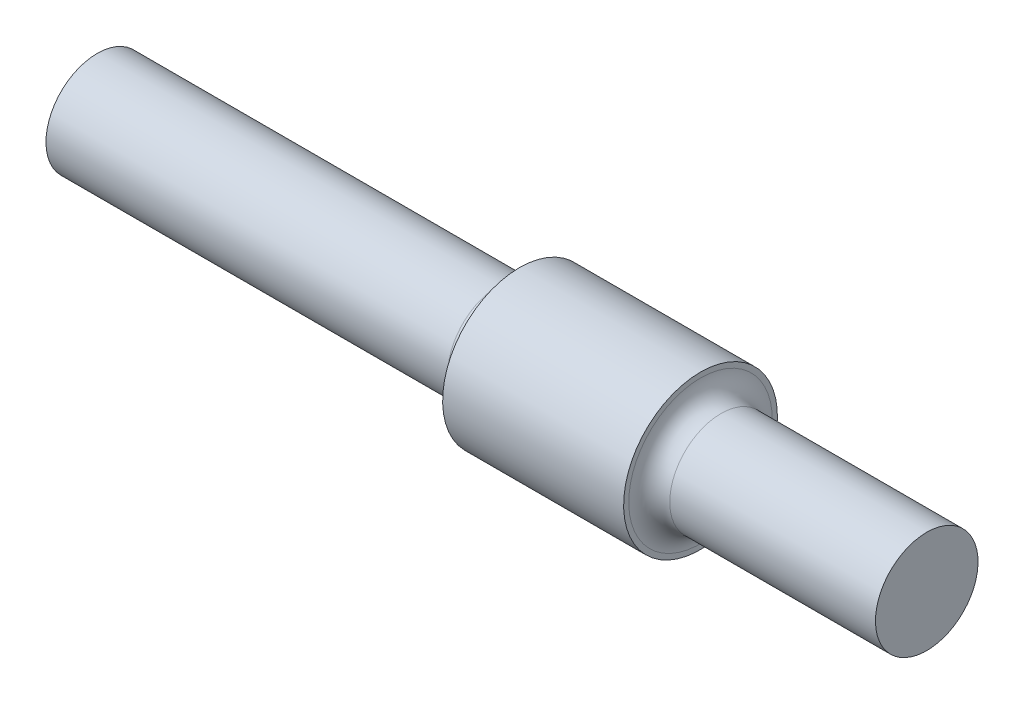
ISO-10303-21;
HEADER;
FILE_DESCRIPTION(('STEP AP214'),'2;1');
FILE_NAME('part.step','',(''),(''),'','','');
FILE_SCHEMA(('AUTOMOTIVE_DESIGN { 1 0 10303 214 1 1 1 1 }'));
ENDSEC;
DATA;
#1=APPLICATION_CONTEXT('core data for automotive mechanical design processes');
#2=APPLICATION_PROTOCOL_DEFINITION('international standard','automotive_design',2000,#1);
#3=PRODUCT_CONTEXT('',#1,'mechanical');
#4=PRODUCT('Part','Part','',(#3));
#5=PRODUCT_RELATED_PRODUCT_CATEGORY('part','',(#4));
#6=PRODUCT_DEFINITION_FORMATION('','',#4);
#7=PRODUCT_DEFINITION_CONTEXT('part definition',#1,'design');
#8=PRODUCT_DEFINITION('design','',#6,#7);
#9=PRODUCT_DEFINITION_SHAPE('','',#8);
#10=(LENGTH_UNIT() NAMED_UNIT(*) SI_UNIT(.MILLI.,.METRE.));
#11=(NAMED_UNIT(*) PLANE_ANGLE_UNIT() SI_UNIT($,.RADIAN.));
#12=(NAMED_UNIT(*) SI_UNIT($,.STERADIAN.) SOLID_ANGLE_UNIT());
#13=UNCERTAINTY_MEASURE_WITH_UNIT(LENGTH_MEASURE(1.E-05),#10,'distance_accuracy_value','');
#14=(GEOMETRIC_REPRESENTATION_CONTEXT(3) GLOBAL_UNCERTAINTY_ASSIGNED_CONTEXT((#13)) GLOBAL_UNIT_ASSIGNED_CONTEXT((#10,
#11,#12)) REPRESENTATION_CONTEXT('',''));
#15=CARTESIAN_POINT('',(0.,0.,0.));
#16=DIRECTION('',(0.,0.,1.));
#17=DIRECTION('',(1.,0.,0.));
#18=AXIS2_PLACEMENT_3D('',#15,#16,#17);
#19=CARTESIAN_POINT('',(137.5,12.75,0.));
#20=DIRECTION('',(1.,0.,0.));
#21=DIRECTION('',(0.,1.,0.));
#22=AXIS2_PLACEMENT_3D('',#19,#20,#21);
#23=CYLINDRICAL_SURFACE('',#22,12.75);
#24=CARTESIAN_POINT('',(70.,12.75,0.));
#25=DIRECTION('',(1.,0.,0.));
#26=DIRECTION('',(0.,1.,0.));
#27=AXIS2_PLACEMENT_3D('',#24,#25,#26);
#28=CIRCLE('',#27,12.75);
#29=CARTESIAN_POINT('',(70.,25.5,0.));
#30=VERTEX_POINT('',#29);
#31=EDGE_CURVE('E100',#30,#30,#28,.T.);
#32=ORIENTED_EDGE('',*,*,#31,.T.);
#33=EDGE_LOOP('',(#32));
#34=FACE_BOUND('',#33,.T.);
#35=CARTESIAN_POINT('',(100.,12.75,0.));
#36=DIRECTION('',(1.,0.,0.));
#37=DIRECTION('',(0.,1.,0.));
#38=AXIS2_PLACEMENT_3D('',#35,#36,#37);
#39=CIRCLE('',#38,12.75);
#40=CARTESIAN_POINT('',(100.,25.5,0.));
#41=VERTEX_POINT('',#40);
#42=EDGE_CURVE('E92',#41,#41,#39,.T.);
#43=ORIENTED_EDGE('',*,*,#42,.F.);
#44=EDGE_LOOP('',(#43));
#45=FACE_BOUND('',#44,.T.);
#46=DIRECTION('',(1.,0.,0.));
#47=VECTOR('',#46,1.);
#48=CARTESIAN_POINT('',(137.5,0.0392761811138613,-1.));
#49=LINE('',#48,#47);
#50=CARTESIAN_POINT('',(94.,0.0392761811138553,-1.));
#51=VERTEX_POINT('',#50);
#52=CARTESIAN_POINT('',(76.,0.0392761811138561,-1.));
#53=VERTEX_POINT('',#52);
#54=EDGE_CURVE('E11',#51,#53,#49,.F.);
#55=ORIENTED_EDGE('',*,*,#54,.T.);
#56=CARTESIAN_POINT('',(76.,0.0392761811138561,-1.));
#57=CARTESIAN_POINT('',(75.9719119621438,0.0392767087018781,-0.999999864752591));
#58=CARTESIAN_POINT('',(75.9438374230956,0.0391829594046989,-0.998815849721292));
#59=CARTESIAN_POINT('',(75.8878900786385,0.0388124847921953,-0.994092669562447));
#60=CARTESIAN_POINT('',(75.8600172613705,0.0385357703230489,-0.990553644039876));
#61=CARTESIAN_POINT('',(75.7770538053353,0.03744078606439,-0.976438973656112));
#62=CARTESIAN_POINT('',(75.7225202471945,0.0363576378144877,-0.962365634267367));
#63=CARTESIAN_POINT('',(75.6166011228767,0.033605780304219,-0.925288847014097));
#64=CARTESIAN_POINT('',(75.5652168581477,0.0319368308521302,-0.902281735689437));
#65=CARTESIAN_POINT('',(75.4670393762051,0.0282021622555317,-0.847995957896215));
#66=CARTESIAN_POINT('',(75.4202454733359,0.0261365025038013,-0.816718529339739));
#67=CARTESIAN_POINT('',(75.3324770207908,0.0218360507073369,-0.746706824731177));
#68=CARTESIAN_POINT('',(75.2915139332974,0.019600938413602,-0.707958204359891));
#69=CARTESIAN_POINT('',(75.2166604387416,0.0152160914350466,-0.624128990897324));
#70=CARTESIAN_POINT('',(75.1827711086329,0.0130663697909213,-0.579047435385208));
#71=CARTESIAN_POINT('',(75.1229951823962,0.00909173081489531,-0.483765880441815));
#72=CARTESIAN_POINT('',(75.0971186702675,0.00726722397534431,-0.433559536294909));
#73=CARTESIAN_POINT('',(75.0541686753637,0.00415222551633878,-0.329501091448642));
#74=CARTESIAN_POINT('',(75.0370945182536,0.00286169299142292,-0.275649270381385));
#75=CARTESIAN_POINT('',(75.012265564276,0.000962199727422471,-0.165943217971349));
#76=CARTESIAN_POINT('',(75.0044916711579,0.000351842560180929,-0.110093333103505));
#77=CARTESIAN_POINT('',(74.9984248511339,-0.000123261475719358,0.00212304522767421));
#78=CARTESIAN_POINT('',(75.0001319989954,1.19975355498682E-05,0.0584895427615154));
#79=CARTESIAN_POINT('',(75.0129634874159,0.00101175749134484,0.170006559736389));
#80=CARTESIAN_POINT('',(75.0240670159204,0.00187464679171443,0.225159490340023));
#81=CARTESIAN_POINT('',(75.0553436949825,0.00423072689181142,0.332816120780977));
#82=CARTESIAN_POINT('',(75.0755168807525,0.00572392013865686,0.385319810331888));
#83=CARTESIAN_POINT('',(75.1243839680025,0.00917539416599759,0.486255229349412));
#84=CARTESIAN_POINT('',(75.1530873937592,0.0111341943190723,0.534682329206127));
#85=CARTESIAN_POINT('',(75.2181919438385,0.0152965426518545,0.626036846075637));
#86=CARTESIAN_POINT('',(75.2545928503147,0.0175000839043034,0.668964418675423));
#87=CARTESIAN_POINT('',(75.3341705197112,0.0219109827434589,0.748219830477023));
#88=CARTESIAN_POINT('',(75.3773643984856,0.0241183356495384,0.78453048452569));
#89=CARTESIAN_POINT('',(75.4692607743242,0.0282830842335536,0.849399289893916));
#90=CARTESIAN_POINT('',(75.517964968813,0.0302404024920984,0.877955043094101));
#91=CARTESIAN_POINT('',(75.6195175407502,0.0336841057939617,0.926501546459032));
#92=CARTESIAN_POINT('',(75.6723688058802,0.0351701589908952,0.946486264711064));
#93=CARTESIAN_POINT('',(75.7806507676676,0.037498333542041,0.977263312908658));
#94=CARTESIAN_POINT('',(75.8360774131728,0.0383414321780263,0.988069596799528));
#95=CARTESIAN_POINT('',(75.9099037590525,0.0389697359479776,0.99609784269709));
#96=CARTESIAN_POINT('',(75.9279076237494,0.0390845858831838,0.997561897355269));
#97=CARTESIAN_POINT('',(75.9639385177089,0.0392377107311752,0.999511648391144));
#98=CARTESIAN_POINT('',(75.981965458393,0.0392761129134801,0.999998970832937));
#99=CARTESIAN_POINT('',(76.,0.0392761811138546,1.));
#100=B_SPLINE_CURVE_WITH_KNOTS('',3,(#56,#57,#58,#59,#60,#61,#62,#63,#64,#65,#66,#67,#68,#69,
#70,#71,#72,#73,#74,#75,#76,#77,#78,#79,#80,#81,#82,#83,#84,#85,#86,#87,#88,#89,#90,#91,#92,#93,
#94,#95,#96,#97,#98,#99),.UNSPECIFIED.,.F.,.F.,(4,2,2,2,2,2,2,2,2,2,2,2,2,2,2,2,2,2,2,2,2,4),
(0.,0.084212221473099,0.168419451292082,0.33654391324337,0.504737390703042,0.672905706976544,
0.841400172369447,1.00992027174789,1.17865159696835,1.34736999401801,1.51574136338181,
1.68411406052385,1.85211480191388,2.02011619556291,2.18830587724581,2.35649079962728,
2.52510648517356,2.69377425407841,2.8625605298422,3.03108973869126,3.08526180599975,
3.13934361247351),.UNSPECIFIED.);
#101=CARTESIAN_POINT('',(76.,0.0392761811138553,1.));
#102=VERTEX_POINT('',#101);
#103=EDGE_CURVE('E118',#53,#102,#100,.T.);
#104=ORIENTED_EDGE('',*,*,#103,.T.);
#105=DIRECTION('',(1.,0.,0.));
#106=VECTOR('',#105,1.);
#107=CARTESIAN_POINT('',(137.5,0.0392761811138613,1.));
#108=LINE('',#107,#106);
#109=CARTESIAN_POINT('',(94.,0.0392761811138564,1.));
#110=VERTEX_POINT('',#109);
#111=EDGE_CURVE('E41',#102,#110,#108,.T.);
#112=ORIENTED_EDGE('',*,*,#111,.T.);
#113=CARTESIAN_POINT('',(94.,0.0392761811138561,1.));
#114=CARTESIAN_POINT('',(94.0280880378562,0.0392767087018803,0.999999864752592));
#115=CARTESIAN_POINT('',(94.0561625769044,0.0391829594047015,0.998815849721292));
#116=CARTESIAN_POINT('',(94.1121099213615,0.0388124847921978,0.994092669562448));
#117=CARTESIAN_POINT('',(94.1399827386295,0.0385357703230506,0.990553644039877));
#118=CARTESIAN_POINT('',(94.2229461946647,0.0374407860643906,0.976438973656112));
#119=CARTESIAN_POINT('',(94.2774797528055,0.0363576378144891,0.962365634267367));
#120=CARTESIAN_POINT('',(94.3833988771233,0.0336057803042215,0.925288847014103));
#121=CARTESIAN_POINT('',(94.4347831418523,0.0319368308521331,0.902281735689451));
#122=CARTESIAN_POINT('',(94.5329606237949,0.0282021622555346,0.847995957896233));
#123=CARTESIAN_POINT('',(94.5797545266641,0.0261365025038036,0.816718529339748));
#124=CARTESIAN_POINT('',(94.6675229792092,0.0218360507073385,0.746706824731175));
#125=CARTESIAN_POINT('',(94.7084860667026,0.0196009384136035,0.707958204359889));
#126=CARTESIAN_POINT('',(94.7833395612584,0.0152160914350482,0.62412899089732));
#127=CARTESIAN_POINT('',(94.8172288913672,0.0130663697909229,0.579047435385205));
#128=CARTESIAN_POINT('',(94.8770048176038,0.00909173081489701,0.483765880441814));
#129=CARTESIAN_POINT('',(94.9028813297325,0.00726722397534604,0.433559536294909));
#130=CARTESIAN_POINT('',(94.9458313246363,0.00415222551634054,0.329501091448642));
#131=CARTESIAN_POINT('',(94.9629054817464,0.00286169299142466,0.275649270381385));
#132=CARTESIAN_POINT('',(94.9877344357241,0.000962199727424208,0.16594321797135));
#133=CARTESIAN_POINT('',(94.9955083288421,0.000351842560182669,0.110093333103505));
#134=CARTESIAN_POINT('',(95.0015751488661,-0.000123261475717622,-0.0021230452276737));
#135=CARTESIAN_POINT('',(94.9998680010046,1.19975355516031E-05,-0.0584895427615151));
#136=CARTESIAN_POINT('',(94.9870365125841,0.00101175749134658,-0.170006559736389));
#137=CARTESIAN_POINT('',(94.9759329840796,0.00187464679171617,-0.225159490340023));
#138=CARTESIAN_POINT('',(94.9446563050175,0.00423072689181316,-0.332816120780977));
#139=CARTESIAN_POINT('',(94.9244831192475,0.0057239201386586,-0.385319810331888));
#140=CARTESIAN_POINT('',(94.8756160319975,0.00917539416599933,-0.486255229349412));
#141=CARTESIAN_POINT('',(94.8469126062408,0.011134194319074,-0.534682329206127));
#142=CARTESIAN_POINT('',(94.7818080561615,0.0152965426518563,-0.626036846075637));
#143=CARTESIAN_POINT('',(94.7454071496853,0.0175000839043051,-0.668964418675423));
#144=CARTESIAN_POINT('',(94.6658294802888,0.0219109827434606,-0.748219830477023));
#145=CARTESIAN_POINT('',(94.6226356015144,0.0241183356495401,-0.78453048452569));
#146=CARTESIAN_POINT('',(94.5307392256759,0.0282830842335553,-0.849399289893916));
#147=CARTESIAN_POINT('',(94.482035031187,0.0302404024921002,-0.877955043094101));
#148=CARTESIAN_POINT('',(94.3804824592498,0.0336841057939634,-0.926501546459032));
#149=CARTESIAN_POINT('',(94.3276311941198,0.0351701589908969,-0.946486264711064));
#150=CARTESIAN_POINT('',(94.2193492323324,0.0374983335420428,-0.977263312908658));
#151=CARTESIAN_POINT('',(94.1639225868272,0.0383414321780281,-0.988069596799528));
#152=CARTESIAN_POINT('',(94.0900962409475,0.0389697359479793,-0.99609784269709));
#153=CARTESIAN_POINT('',(94.0720923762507,0.0390845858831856,-0.997561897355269));
#154=CARTESIAN_POINT('',(94.0360614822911,0.0392377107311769,-0.999511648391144));
#155=CARTESIAN_POINT('',(94.018034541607,0.0392761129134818,-0.999998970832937));
#156=CARTESIAN_POINT('',(94.,0.0392761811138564,-1.));
#157=B_SPLINE_CURVE_WITH_KNOTS('',3,(#113,#114,#115,#116,#117,#118,#119,#120,#121,#122,#123,
#124,#125,#126,#127,#128,#129,#130,#131,#132,#133,#134,#135,#136,#137,#138,#139,#140,#141,#142,
#143,#144,#145,#146,#147,#148,#149,#150,#151,#152,#153,#154,#155,#156),.UNSPECIFIED.,.F.,.F.,(4,
2,2,2,2,2,2,2,2,2,2,2,2,2,2,2,2,2,2,2,2,4),(0.,0.0842122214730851,0.168419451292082,
0.33654391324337,0.504737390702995,0.672905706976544,0.841400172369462,1.0099202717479,
1.17865159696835,1.34736999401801,1.51574136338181,1.68411406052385,1.85211480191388,
2.02011619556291,2.18830587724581,2.35649079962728,2.52510648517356,2.69377425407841,
2.8625605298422,3.03108973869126,3.08526180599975,3.13934361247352),.UNSPECIFIED.);
#158=EDGE_CURVE('E48',#110,#51,#157,.T.);
#159=ORIENTED_EDGE('',*,*,#158,.T.);
#160=EDGE_LOOP('',(#55,#104,#112,#159));
#161=FACE_BOUND('',#160,.T.);
#162=ADVANCED_FACE('F33',(#34,#45,#161),#23,.T.);
#163=CARTESIAN_POINT('',(0.,12.75,0.));
#164=DIRECTION('',(-1.,0.,0.));
#165=DIRECTION('',(0.,-1.,0.));
#166=AXIS2_PLACEMENT_3D('',#163,#164,#165);
#167=PLANE('',#166);
#168=CARTESIAN_POINT('',(0.,12.75,0.));
#169=DIRECTION('',(1.,0.,0.));
#170=DIRECTION('',(0.,1.,0.));
#171=AXIS2_PLACEMENT_3D('',#168,#169,#170);
#172=CIRCLE('',#171,8.5);
#173=CARTESIAN_POINT('',(0.,21.25,0.));
#174=VERTEX_POINT('',#173);
#175=EDGE_CURVE('E103',#174,#174,#172,.T.);
#176=ORIENTED_EDGE('',*,*,#175,.F.);
#177=EDGE_LOOP('',(#176));
#178=FACE_BOUND('',#177,.T.);
#179=ADVANCED_FACE('F166',(#178),#167,.T.);
#180=CARTESIAN_POINT('',(137.5,12.75,0.));
#181=DIRECTION('',(1.,0.,0.));
#182=DIRECTION('',(0.,1.,0.));
#183=AXIS2_PLACEMENT_3D('',#180,#181,#182);
#184=CYLINDRICAL_SURFACE('',#183,8.5);
#185=CARTESIAN_POINT('',(66.6,12.75,0.));
#186=DIRECTION('',(-1.,0.,0.));
#187=DIRECTION('',(0.,-1.,0.));
#188=AXIS2_PLACEMENT_3D('',#185,#186,#187);
#189=CIRCLE('',#188,8.5);
#190=CARTESIAN_POINT('',(66.6,4.25000000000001,0.));
#191=VERTEX_POINT('',#190);
#192=EDGE_CURVE('E115',#191,#191,#189,.T.);
#193=ORIENTED_EDGE('',*,*,#192,.T.);
#194=EDGE_LOOP('',(#193));
#195=FACE_BOUND('',#194,.T.);
#196=ORIENTED_EDGE('',*,*,#175,.T.);
#197=EDGE_LOOP('',(#196));
#198=FACE_BOUND('',#197,.T.);
#199=ADVANCED_FACE('F162',(#195,#198),#184,.T.);
#200=CARTESIAN_POINT('',(70.,21.25,0.));
#201=DIRECTION('',(-1.,0.,0.));
#202=DIRECTION('',(0.,-1.,0.));
#203=AXIS2_PLACEMENT_3D('',#200,#201,#202);
#204=PLANE('',#203);
#205=CARTESIAN_POINT('',(70.,12.75,0.));
#206=DIRECTION('',(-1.,0.,0.));
#207=DIRECTION('',(0.,-1.,0.));
#208=AXIS2_PLACEMENT_3D('',#205,#206,#207);
#209=CIRCLE('',#208,11.9);
#210=CARTESIAN_POINT('',(70.,0.850000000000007,0.));
#211=VERTEX_POINT('',#210);
#212=EDGE_CURVE('E112',#211,#211,#209,.F.);
#213=ORIENTED_EDGE('',*,*,#212,.T.);
#214=EDGE_LOOP('',(#213));
#215=FACE_BOUND('',#214,.T.);
#216=ORIENTED_EDGE('',*,*,#31,.F.);
#217=EDGE_LOOP('',(#216));
#218=FACE_BOUND('',#217,.T.);
#219=ADVANCED_FACE('F157',(#215,#218),#204,.T.);
#220=CARTESIAN_POINT('',(100.,25.5,0.));
#221=DIRECTION('',(1.,0.,0.));
#222=DIRECTION('',(0.,1.,0.));
#223=AXIS2_PLACEMENT_3D('',#220,#221,#222);
#224=PLANE('',#223);
#225=CARTESIAN_POINT('',(100.,12.75,0.));
#226=DIRECTION('',(1.,0.,0.));
#227=DIRECTION('',(0.,1.,0.));
#228=AXIS2_PLACEMENT_3D('',#225,#226,#227);
#229=CIRCLE('',#228,11.9);
#230=CARTESIAN_POINT('',(100.,24.65,0.));
#231=VERTEX_POINT('',#230);
#232=EDGE_CURVE('E109',#231,#231,#229,.F.);
#233=ORIENTED_EDGE('',*,*,#232,.T.);
#234=EDGE_LOOP('',(#233));
#235=FACE_BOUND('',#234,.T.);
#236=ORIENTED_EDGE('',*,*,#42,.T.);
#237=EDGE_LOOP('',(#236));
#238=FACE_BOUND('',#237,.T.);
#239=ADVANCED_FACE('F154',(#235,#238),#224,.T.);
#240=CARTESIAN_POINT('',(137.5,12.75,0.));
#241=DIRECTION('',(1.,0.,0.));
#242=DIRECTION('',(0.,1.,0.));
#243=AXIS2_PLACEMENT_3D('',#240,#241,#242);
#244=CYLINDRICAL_SURFACE('',#243,8.49999999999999);
#245=CARTESIAN_POINT('',(103.4,12.75,0.));
#246=DIRECTION('',(1.,0.,0.));
#247=DIRECTION('',(0.,1.,0.));
#248=AXIS2_PLACEMENT_3D('',#245,#246,#247);
#249=CIRCLE('',#248,8.49999999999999);
#250=CARTESIAN_POINT('',(103.4,21.25,0.));
#251=VERTEX_POINT('',#250);
#252=EDGE_CURVE('E106',#251,#251,#249,.T.);
#253=ORIENTED_EDGE('',*,*,#252,.T.);
#254=EDGE_LOOP('',(#253));
#255=FACE_BOUND('',#254,.T.);
#256=CARTESIAN_POINT('',(137.5,12.75,0.));
#257=DIRECTION('',(1.,0.,0.));
#258=DIRECTION('',(0.,1.,0.));
#259=AXIS2_PLACEMENT_3D('',#256,#257,#258);
#260=CIRCLE('',#259,8.49999999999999);
#261=CARTESIAN_POINT('',(137.5,21.25,0.));
#262=VERTEX_POINT('',#261);
#263=EDGE_CURVE('E88',#262,#262,#260,.T.);
#264=ORIENTED_EDGE('',*,*,#263,.F.);
#265=EDGE_LOOP('',(#264));
#266=FACE_BOUND('',#265,.T.);
#267=ADVANCED_FACE('F151',(#255,#266),#244,.T.);
#268=CARTESIAN_POINT('',(137.5,21.25,0.));
#269=DIRECTION('',(1.,0.,0.));
#270=DIRECTION('',(0.,1.,0.));
#271=AXIS2_PLACEMENT_3D('',#268,#269,#270);
#272=PLANE('',#271);
#273=ORIENTED_EDGE('',*,*,#263,.T.);
#274=EDGE_LOOP('',(#273));
#275=FACE_BOUND('',#274,.T.);
#276=ADVANCED_FACE('F147',(#275),#272,.T.);
#277=CARTESIAN_POINT('',(103.4,12.75,0.));
#278=DIRECTION('',(1.,0.,0.));
#279=DIRECTION('',(0.,1.,0.));
#280=AXIS2_PLACEMENT_3D('',#277,#278,#279);
#281=TOROIDAL_SURFACE('',#280,11.9,3.4);
#282=ORIENTED_EDGE('',*,*,#232,.F.);
#283=EDGE_LOOP('',(#282));
#284=FACE_BOUND('',#283,.T.);
#285=ORIENTED_EDGE('',*,*,#252,.F.);
#286=EDGE_LOOP('',(#285));
#287=FACE_BOUND('',#286,.T.);
#288=ADVANCED_FACE('F150',(#284,#287),#281,.F.);
#289=CARTESIAN_POINT('',(66.6,12.75,0.));
#290=DIRECTION('',(-1.,0.,0.));
#291=DIRECTION('',(0.,-1.,0.));
#292=AXIS2_PLACEMENT_3D('',#289,#290,#291);
#293=TOROIDAL_SURFACE('',#292,11.9,3.4);
#294=ORIENTED_EDGE('',*,*,#192,.F.);
#295=EDGE_LOOP('',(#294));
#296=FACE_BOUND('',#295,.T.);
#297=ORIENTED_EDGE('',*,*,#212,.F.);
#298=EDGE_LOOP('',(#297));
#299=FACE_BOUND('',#298,.T.);
#300=ADVANCED_FACE('F35',(#296,#299),#293,.F.);
#301=CARTESIAN_POINT('',(94.,1.,0.));
#302=DIRECTION('',(0.,-1.,0.));
#303=DIRECTION('',(0.,0.,-1.));
#304=AXIS2_PLACEMENT_3D('',#301,#302,#303);
#305=CYLINDRICAL_SURFACE('',#304,1.);
#306=DIRECTION('',(0.,-1.,0.));
#307=VECTOR('',#306,1.);
#308=CARTESIAN_POINT('',(94.,1.,1.));
#309=LINE('',#308,#307);
#310=CARTESIAN_POINT('',(94.,1.,1.));
#311=VERTEX_POINT('',#310);
#312=EDGE_CURVE('E85',#311,#110,#309,.T.);
#313=ORIENTED_EDGE('',*,*,#312,.F.);
#314=CARTESIAN_POINT('',(94.,1.,0.));
#315=DIRECTION('',(0.,1.,0.));
#316=DIRECTION('',(0.,0.,1.));
#317=AXIS2_PLACEMENT_3D('',#314,#315,#316);
#318=CIRCLE('',#317,1.);
#319=CARTESIAN_POINT('',(94.,1.,-1.));
#320=VERTEX_POINT('',#319);
#321=EDGE_CURVE('E79',#311,#320,#318,.T.);
#322=ORIENTED_EDGE('',*,*,#321,.T.);
#323=DIRECTION('',(0.,-1.,0.));
#324=VECTOR('',#323,1.);
#325=CARTESIAN_POINT('',(94.,1.,-1.));
#326=LINE('',#325,#324);
#327=EDGE_CURVE('E84',#320,#51,#326,.T.);
#328=ORIENTED_EDGE('',*,*,#327,.T.);
#329=ORIENTED_EDGE('',*,*,#158,.F.);
#330=EDGE_LOOP('',(#313,#322,#328,#329));
#331=FACE_BOUND('',#330,.T.);
#332=ADVANCED_FACE('F83',(#331),#305,.F.);
#333=CARTESIAN_POINT('',(94.,1.,-1.));
#334=DIRECTION('',(0.,0.,1.));
#335=DIRECTION('',(1.,0.,0.));
#336=AXIS2_PLACEMENT_3D('',#333,#334,#335);
#337=PLANE('',#336);
#338=ORIENTED_EDGE('',*,*,#327,.F.);
#339=DIRECTION('',(-1.,0.,0.));
#340=VECTOR('',#339,1.);
#341=CARTESIAN_POINT('',(94.,1.,-1.));
#342=LINE('',#341,#340);
#343=CARTESIAN_POINT('',(76.,1.,-1.));
#344=VERTEX_POINT('',#343);
#345=EDGE_CURVE('E75',#320,#344,#342,.T.);
#346=ORIENTED_EDGE('',*,*,#345,.T.);
#347=DIRECTION('',(0.,-1.,0.));
#348=VECTOR('',#347,1.);
#349=CARTESIAN_POINT('',(76.,1.,-1.));
#350=LINE('',#349,#348);
#351=EDGE_CURVE('E89',#344,#53,#350,.T.);
#352=ORIENTED_EDGE('',*,*,#351,.T.);
#353=ORIENTED_EDGE('',*,*,#54,.F.);
#354=EDGE_LOOP('',(#338,#346,#352,#353));
#355=FACE_BOUND('',#354,.T.);
#356=ADVANCED_FACE('F87',(#355),#337,.T.);
#357=CARTESIAN_POINT('',(76.,1.,0.));
#358=DIRECTION('',(0.,-1.,0.));
#359=DIRECTION('',(0.,0.,-1.));
#360=AXIS2_PLACEMENT_3D('',#357,#358,#359);
#361=CYLINDRICAL_SURFACE('',#360,1.);
#362=ORIENTED_EDGE('',*,*,#351,.F.);
#363=CARTESIAN_POINT('',(76.,1.,0.));
#364=DIRECTION('',(0.,1.,0.));
#365=DIRECTION('',(0.,0.,1.));
#366=AXIS2_PLACEMENT_3D('',#363,#364,#365);
#367=CIRCLE('',#366,1.);
#368=CARTESIAN_POINT('',(76.,1.,1.));
#369=VERTEX_POINT('',#368);
#370=EDGE_CURVE('E80',#344,#369,#367,.T.);
#371=ORIENTED_EDGE('',*,*,#370,.T.);
#372=DIRECTION('',(0.,-1.,0.));
#373=VECTOR('',#372,1.);
#374=CARTESIAN_POINT('',(76.,1.,1.));
#375=LINE('',#374,#373);
#376=EDGE_CURVE('E94',#369,#102,#375,.T.);
#377=ORIENTED_EDGE('',*,*,#376,.T.);
#378=ORIENTED_EDGE('',*,*,#103,.F.);
#379=EDGE_LOOP('',(#362,#371,#377,#378));
#380=FACE_BOUND('',#379,.T.);
#381=ADVANCED_FACE('F135',(#380),#361,.F.);
#382=CARTESIAN_POINT('',(76.,1.,1.));
#383=DIRECTION('',(0.,0.,-1.));
#384=DIRECTION('',(-1.,0.,0.));
#385=AXIS2_PLACEMENT_3D('',#382,#383,#384);
#386=PLANE('',#385);
#387=ORIENTED_EDGE('',*,*,#376,.F.);
#388=DIRECTION('',(1.,0.,0.));
#389=VECTOR('',#388,1.);
#390=CARTESIAN_POINT('',(76.,1.,1.));
#391=LINE('',#390,#389);
#392=EDGE_CURVE('E181',#369,#311,#391,.T.);
#393=ORIENTED_EDGE('',*,*,#392,.T.);
#394=ORIENTED_EDGE('',*,*,#312,.T.);
#395=ORIENTED_EDGE('',*,*,#111,.F.);
#396=EDGE_LOOP('',(#387,#393,#394,#395));
#397=FACE_BOUND('',#396,.T.);
#398=ADVANCED_FACE('F140',(#397),#386,.T.);
#399=CARTESIAN_POINT('',(94.,1.,0.));
#400=DIRECTION('',(0.,1.,0.));
#401=DIRECTION('',(0.,0.,1.));
#402=AXIS2_PLACEMENT_3D('',#399,#400,#401);
#403=PLANE('',#402);
#404=ORIENTED_EDGE('',*,*,#321,.F.);
#405=ORIENTED_EDGE('',*,*,#392,.F.);
#406=ORIENTED_EDGE('',*,*,#370,.F.);
#407=ORIENTED_EDGE('',*,*,#345,.F.);
#408=EDGE_LOOP('',(#404,#405,#406,#407));
#409=FACE_BOUND('',#408,.T.);
#410=ADVANCED_FACE('F77',(#409),#403,.F.);
#411=CLOSED_SHELL('',(#162,#179,#199,#219,#239,#267,#276,#288,#300,#332,#356,#381,#398,#410));
#412=MANIFOLD_SOLID_BREP('B2',#411);
#413=ADVANCED_BREP_SHAPE_REPRESENTATION('',(#18,#412),#14);
#414=SHAPE_DEFINITION_REPRESENTATION(#9,#413);
ENDSEC;
END-ISO-10303-21;
